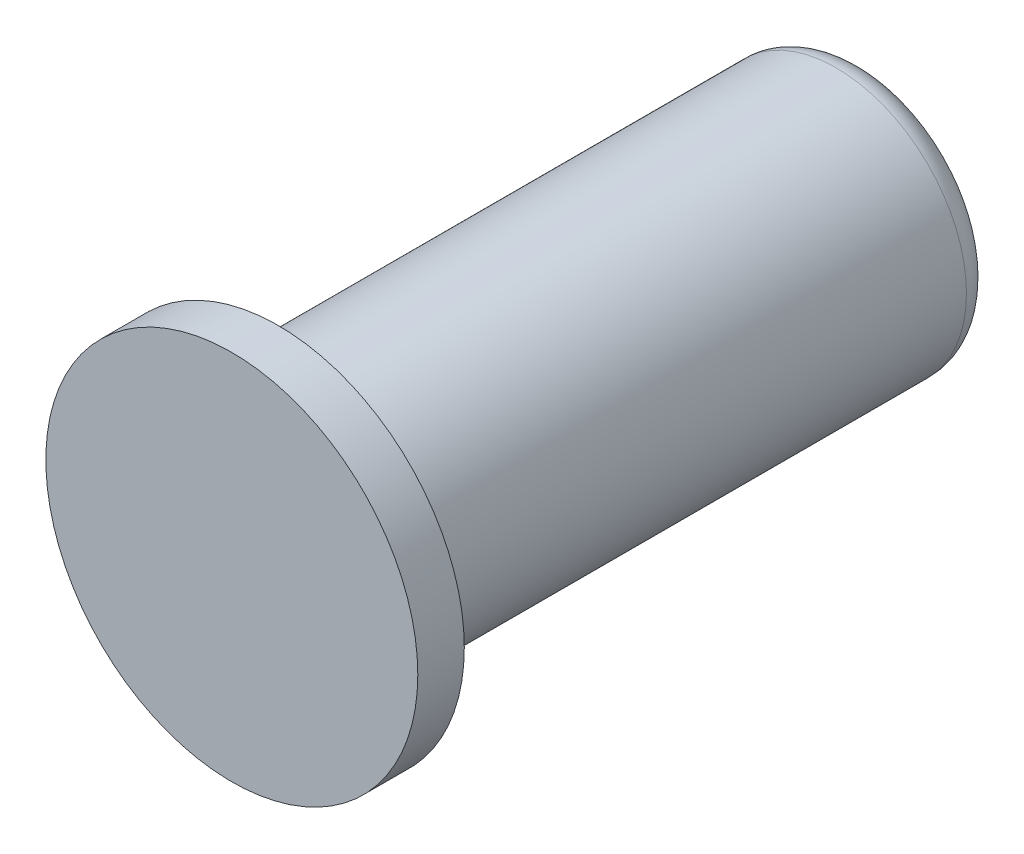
ISO-10303-21;
HEADER;
FILE_DESCRIPTION(('STEP AP214'),'2;1');
FILE_NAME('part.step','',(''),(''),'','','');
FILE_SCHEMA(('AUTOMOTIVE_DESIGN { 1 0 10303 214 1 1 1 1 }'));
ENDSEC;
DATA;
#1=APPLICATION_CONTEXT('core data for automotive mechanical design processes');
#2=APPLICATION_PROTOCOL_DEFINITION('international standard','automotive_design',2000,#1);
#3=PRODUCT_CONTEXT('',#1,'mechanical');
#4=PRODUCT('Part','Part','',(#3));
#5=PRODUCT_RELATED_PRODUCT_CATEGORY('part','',(#4));
#6=PRODUCT_DEFINITION_FORMATION('','',#4);
#7=PRODUCT_DEFINITION_CONTEXT('part definition',#1,'design');
#8=PRODUCT_DEFINITION('design','',#6,#7);
#9=PRODUCT_DEFINITION_SHAPE('','',#8);
#10=(LENGTH_UNIT() NAMED_UNIT(*) SI_UNIT(.MILLI.,.METRE.));
#11=(NAMED_UNIT(*) PLANE_ANGLE_UNIT() SI_UNIT($,.RADIAN.));
#12=(NAMED_UNIT(*) SI_UNIT($,.STERADIAN.) SOLID_ANGLE_UNIT());
#13=UNCERTAINTY_MEASURE_WITH_UNIT(LENGTH_MEASURE(1.E-05),#10,'distance_accuracy_value','');
#14=(GEOMETRIC_REPRESENTATION_CONTEXT(3) GLOBAL_UNCERTAINTY_ASSIGNED_CONTEXT((#13)) GLOBAL_UNIT_ASSIGNED_CONTEXT((#10,
#11,#12)) REPRESENTATION_CONTEXT('',''));
#15=CARTESIAN_POINT('',(0.,0.,0.));
#16=DIRECTION('',(0.,0.,1.));
#17=DIRECTION('',(1.,0.,0.));
#18=AXIS2_PLACEMENT_3D('',#15,#16,#17);
#19=CARTESIAN_POINT('',(0.,0.,0.));
#20=DIRECTION('',(0.,0.,-1.));
#21=DIRECTION('',(-1.,0.,0.));
#22=AXIS2_PLACEMENT_3D('',#19,#20,#21);
#23=PLANE('',#22);
#24=CARTESIAN_POINT('',(0.,0.,0.));
#25=DIRECTION('',(0.,0.,1.));
#26=DIRECTION('',(1.,0.,0.));
#27=AXIS2_PLACEMENT_3D('',#24,#25,#26);
#28=CIRCLE('',#27,20.);
#29=CARTESIAN_POINT('',(20.,0.,0.));
#30=VERTEX_POINT('',#29);
#31=EDGE_CURVE('E11',#30,#30,#28,.T.);
#32=ORIENTED_EDGE('',*,*,#31,.T.);
#33=EDGE_LOOP('',(#32));
#34=FACE_BOUND('',#33,.T.);
#35=ADVANCED_FACE('F32',(#34),#23,.F.);
#36=CARTESIAN_POINT('',(0.,0.,0.));
#37=DIRECTION('',(0.,0.,1.));
#38=DIRECTION('',(1.,0.,0.));
#39=AXIS2_PLACEMENT_3D('',#36,#37,#38);
#40=CYLINDRICAL_SURFACE('',#39,20.);
#41=ORIENTED_EDGE('',*,*,#31,.F.);
#42=EDGE_LOOP('',(#41));
#43=FACE_BOUND('',#42,.T.);
#44=CARTESIAN_POINT('',(0.,0.,-5.));
#45=DIRECTION('',(0.,0.,1.));
#46=DIRECTION('',(1.,0.,0.));
#47=AXIS2_PLACEMENT_3D('',#44,#45,#46);
#48=CIRCLE('',#47,20.);
#49=CARTESIAN_POINT('',(20.,0.,-5.));
#50=VERTEX_POINT('',#49);
#51=EDGE_CURVE('E38',#50,#50,#48,.T.);
#52=ORIENTED_EDGE('',*,*,#51,.T.);
#53=EDGE_LOOP('',(#52));
#54=FACE_BOUND('',#53,.T.);
#55=ADVANCED_FACE('F54',(#43,#54),#40,.T.);
#56=CARTESIAN_POINT('',(0.,20.,-5.));
#57=DIRECTION('',(0.,0.,1.));
#58=DIRECTION('',(1.,0.,0.));
#59=AXIS2_PLACEMENT_3D('',#56,#57,#58);
#60=PLANE('',#59);
#61=ORIENTED_EDGE('',*,*,#51,.F.);
#62=EDGE_LOOP('',(#61));
#63=FACE_BOUND('',#62,.T.);
#64=CARTESIAN_POINT('',(0.,0.,-5.));
#65=DIRECTION('',(0.,0.,1.));
#66=DIRECTION('',(1.,0.,0.));
#67=AXIS2_PLACEMENT_3D('',#64,#65,#66);
#68=CIRCLE('',#67,14.);
#69=CARTESIAN_POINT('',(14.,0.,-5.));
#70=VERTEX_POINT('',#69);
#71=EDGE_CURVE('E66',#70,#70,#68,.T.);
#72=ORIENTED_EDGE('',*,*,#71,.T.);
#73=EDGE_LOOP('',(#72));
#74=FACE_BOUND('',#73,.T.);
#75=ADVANCED_FACE('F59',(#63,#74),#60,.F.);
#76=CARTESIAN_POINT('',(0.,0.,0.));
#77=DIRECTION('',(0.,0.,1.));
#78=DIRECTION('',(1.,0.,0.));
#79=AXIS2_PLACEMENT_3D('',#76,#77,#78);
#80=CYLINDRICAL_SURFACE('',#79,14.);
#81=ORIENTED_EDGE('',*,*,#71,.F.);
#82=EDGE_LOOP('',(#81));
#83=FACE_BOUND('',#82,.T.);
#84=CARTESIAN_POINT('',(0.,0.,-65.));
#85=DIRECTION('',(0.,0.,1.));
#86=DIRECTION('',(1.,0.,0.));
#87=AXIS2_PLACEMENT_3D('',#84,#85,#86);
#88=CIRCLE('',#87,14.);
#89=CARTESIAN_POINT('',(14.,0.,-65.));
#90=VERTEX_POINT('',#89);
#91=EDGE_CURVE('E68',#90,#90,#88,.T.);
#92=ORIENTED_EDGE('',*,*,#91,.T.);
#93=EDGE_LOOP('',(#92));
#94=FACE_BOUND('',#93,.T.);
#95=ADVANCED_FACE('F101',(#83,#94),#80,.T.);
#96=CARTESIAN_POINT('',(0.,0.,-65.));
#97=DIRECTION('',(0.,0.,1.));
#98=DIRECTION('',(1.,0.,0.));
#99=AXIS2_PLACEMENT_3D('',#96,#97,#98);
#100=TOROIDAL_SURFACE('',#99,11.,3.);
#101=ORIENTED_EDGE('',*,*,#91,.F.);
#102=EDGE_LOOP('',(#101));
#103=FACE_BOUND('',#102,.T.);
#104=CARTESIAN_POINT('',(0.,0.,-68.));
#105=DIRECTION('',(0.,0.,1.));
#106=DIRECTION('',(1.,0.,0.));
#107=AXIS2_PLACEMENT_3D('',#104,#105,#106);
#108=CIRCLE('',#107,11.);
#109=CARTESIAN_POINT('',(11.,0.,-68.));
#110=VERTEX_POINT('',#109);
#111=EDGE_CURVE('E73',#110,#110,#108,.T.);
#112=ORIENTED_EDGE('',*,*,#111,.T.);
#113=EDGE_LOOP('',(#112));
#114=FACE_BOUND('',#113,.T.);
#115=ADVANCED_FACE('F94',(#103,#114),#100,.T.);
#116=CARTESIAN_POINT('',(0.,11.,-68.));
#117=DIRECTION('',(0.,0.,1.));
#118=DIRECTION('',(1.,0.,0.));
#119=AXIS2_PLACEMENT_3D('',#116,#117,#118);
#120=PLANE('',#119);
#121=ORIENTED_EDGE('',*,*,#111,.F.);
#122=EDGE_LOOP('',(#121));
#123=FACE_BOUND('',#122,.T.);
#124=CARTESIAN_POINT('',(0.,0.,-68.));
#125=DIRECTION('',(0.,0.,1.));
#126=DIRECTION('',(1.,0.,0.));
#127=AXIS2_PLACEMENT_3D('',#124,#125,#126);
#128=CIRCLE('',#127,3.5);
#129=CARTESIAN_POINT('',(3.5,0.,-68.));
#130=VERTEX_POINT('',#129);
#131=EDGE_CURVE('E76',#130,#130,#128,.T.);
#132=ORIENTED_EDGE('',*,*,#131,.T.);
#133=EDGE_LOOP('',(#132));
#134=FACE_BOUND('',#133,.T.);
#135=ADVANCED_FACE('F88',(#123,#134),#120,.F.);
#136=CARTESIAN_POINT('',(0.,0.,-67.5));
#137=DIRECTION('',(0.,0.,-1.));
#138=DIRECTION('',(-1.,0.,0.));
#139=AXIS2_PLACEMENT_3D('',#136,#137,#138);
#140=CONICAL_SURFACE('',#139,3.,0.785398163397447);
#141=ORIENTED_EDGE('',*,*,#131,.F.);
#142=EDGE_LOOP('',(#141));
#143=FACE_BOUND('',#142,.T.);
#144=CARTESIAN_POINT('',(0.,0.,-67.5));
#145=DIRECTION('',(0.,0.,1.));
#146=DIRECTION('',(1.,0.,0.));
#147=AXIS2_PLACEMENT_3D('',#144,#145,#146);
#148=CIRCLE('',#147,3.);
#149=CARTESIAN_POINT('',(3.,0.,-67.5));
#150=VERTEX_POINT('',#149);
#151=EDGE_CURVE('E79',#150,#150,#148,.T.);
#152=ORIENTED_EDGE('',*,*,#151,.T.);
#153=EDGE_LOOP('',(#152));
#154=FACE_BOUND('',#153,.T.);
#155=ADVANCED_FACE('F49',(#143,#154),#140,.F.);
#156=CARTESIAN_POINT('',(0.,0.,0.));
#157=DIRECTION('',(0.,0.,1.));
#158=DIRECTION('',(1.,0.,0.));
#159=AXIS2_PLACEMENT_3D('',#156,#157,#158);
#160=CYLINDRICAL_SURFACE('',#159,3.);
#161=ORIENTED_EDGE('',*,*,#151,.F.);
#162=EDGE_LOOP('',(#161));
#163=FACE_BOUND('',#162,.T.);
#164=CARTESIAN_POINT('',(0.,0.,-59.));
#165=DIRECTION('',(0.,0.,1.));
#166=DIRECTION('',(1.,0.,0.));
#167=AXIS2_PLACEMENT_3D('',#164,#165,#166);
#168=CIRCLE('',#167,3.);
#169=CARTESIAN_POINT('',(3.,0.,-59.));
#170=VERTEX_POINT('',#169);
#171=EDGE_CURVE('E82',#170,#170,#168,.T.);
#172=ORIENTED_EDGE('',*,*,#171,.T.);
#173=EDGE_LOOP('',(#172));
#174=FACE_BOUND('',#173,.T.);
#175=ADVANCED_FACE('F43',(#163,#174),#160,.F.);
#176=CARTESIAN_POINT('',(0.,0.,-57.2679491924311));
#177=DIRECTION('',(0.,0.,-1.));
#178=DIRECTION('',(-1.,0.,0.));
#179=AXIS2_PLACEMENT_3D('',#176,#177,#178);
#180=CONICAL_SURFACE('',#179,0.,1.04719755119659);
#181=ORIENTED_EDGE('',*,*,#171,.F.);
#182=EDGE_LOOP('',(#181));
#183=FACE_BOUND('',#182,.T.);
#184=CARTESIAN_POINT('',(0.,0.,-57.2679491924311));
#185=VERTEX_POINT('',#184);
#186=VERTEX_LOOP('',#185);
#187=FACE_BOUND('',#186,.T.);
#188=ADVANCED_FACE('F41',(#183,#187),#180,.F.);
#189=CLOSED_SHELL('',(#35,#55,#75,#95,#115,#135,#155,#175,#188));
#190=MANIFOLD_SOLID_BREP('B2',#189);
#191=ADVANCED_BREP_SHAPE_REPRESENTATION('',(#18,#190),#14);
#192=SHAPE_DEFINITION_REPRESENTATION(#9,#191);
ENDSEC;
END-ISO-10303-21;
